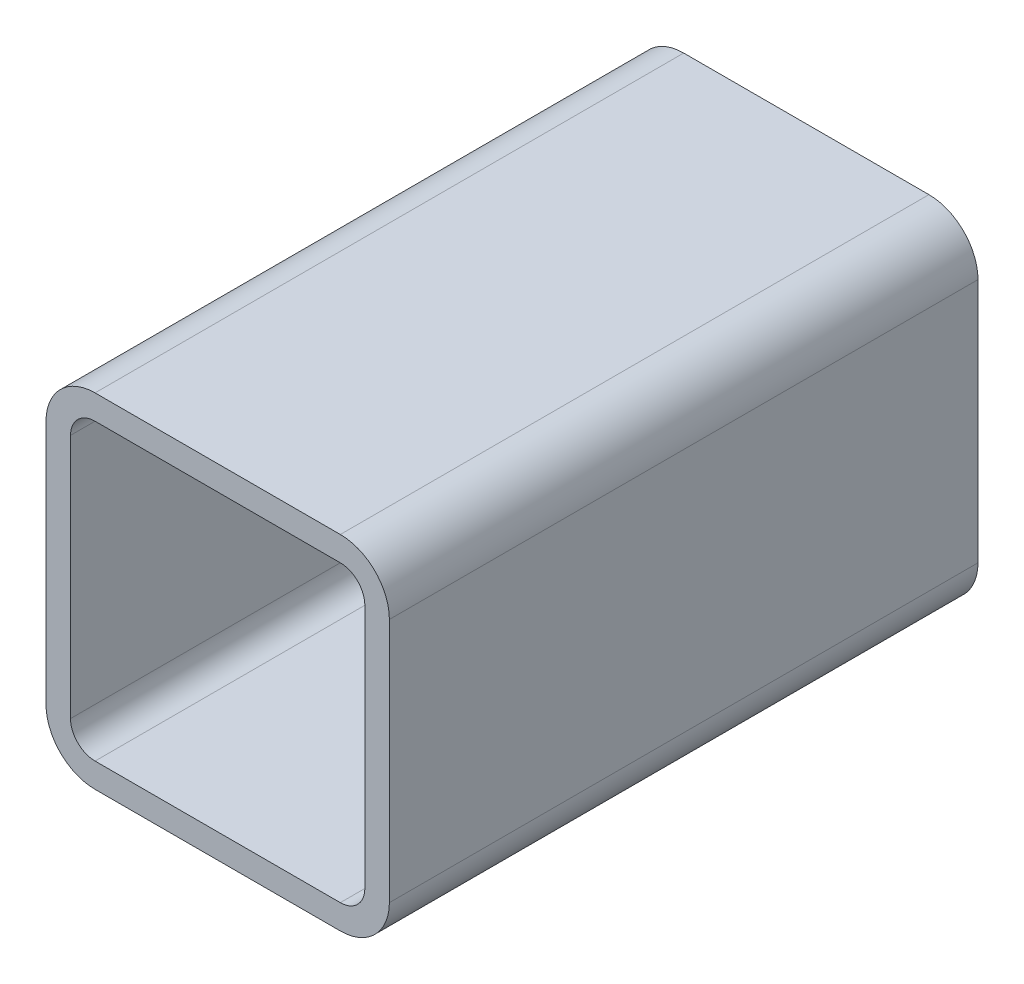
ISO-10303-21;
HEADER;
FILE_DESCRIPTION(('STEP AP214'),'2;1');
FILE_NAME('part.step','',(''),(''),'','','');
FILE_SCHEMA(('AUTOMOTIVE_DESIGN { 1 0 10303 214 1 1 1 1 }'));
ENDSEC;
DATA;
#1=APPLICATION_CONTEXT('core data for automotive mechanical design processes');
#2=APPLICATION_PROTOCOL_DEFINITION('international standard','automotive_design',2000,#1);
#3=PRODUCT_CONTEXT('',#1,'mechanical');
#4=PRODUCT('Part','Part','',(#3));
#5=PRODUCT_RELATED_PRODUCT_CATEGORY('part','',(#4));
#6=PRODUCT_DEFINITION_FORMATION('','',#4);
#7=PRODUCT_DEFINITION_CONTEXT('part definition',#1,'design');
#8=PRODUCT_DEFINITION('design','',#6,#7);
#9=PRODUCT_DEFINITION_SHAPE('','',#8);
#10=(LENGTH_UNIT() NAMED_UNIT(*) SI_UNIT(.MILLI.,.METRE.));
#11=(NAMED_UNIT(*) PLANE_ANGLE_UNIT() SI_UNIT($,.RADIAN.));
#12=(NAMED_UNIT(*) SI_UNIT($,.STERADIAN.) SOLID_ANGLE_UNIT());
#13=UNCERTAINTY_MEASURE_WITH_UNIT(LENGTH_MEASURE(1.E-05),#10,'distance_accuracy_value','');
#14=(GEOMETRIC_REPRESENTATION_CONTEXT(3) GLOBAL_UNCERTAINTY_ASSIGNED_CONTEXT((#13)) GLOBAL_UNIT_ASSIGNED_CONTEXT((#10,
#11,#12)) REPRESENTATION_CONTEXT('',''));
#15=CARTESIAN_POINT('',(0.,0.,0.));
#16=DIRECTION('',(0.,0.,1.));
#17=DIRECTION('',(1.,0.,0.));
#18=AXIS2_PLACEMENT_3D('',#15,#16,#17);
#19=CARTESIAN_POINT('',(27.6048786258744,154.389039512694,304.8));
#20=DIRECTION('',(0.,0.,1.));
#21=DIRECTION('',(1.,0.,0.));
#22=AXIS2_PLACEMENT_3D('',#19,#20,#21);
#23=PLANE('',#22);
#24=CARTESIAN_POINT('',(27.6048786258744,154.389039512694,304.8));
#25=DIRECTION('',(0.,0.,1.));
#26=DIRECTION('',(1.,0.,0.));
#27=AXIS2_PLACEMENT_3D('',#24,#25,#26);
#28=CIRCLE('',#27,25.4);
#29=CARTESIAN_POINT('',(27.6048786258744,179.789039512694,304.8));
#30=VERTEX_POINT('',#29);
#31=CARTESIAN_POINT('',(2.20487862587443,154.389039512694,304.8));
#32=VERTEX_POINT('',#31);
#33=EDGE_CURVE('E211',#30,#32,#28,.T.);
#34=ORIENTED_EDGE('',*,*,#33,.T.);
#35=DIRECTION('',(0.,-1.,0.));
#36=VECTOR('',#35,1.);
#37=CARTESIAN_POINT('',(2.20487862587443,27.3890395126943,304.8));
#38=LINE('',#37,#36);
#39=CARTESIAN_POINT('',(2.20487862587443,27.3890395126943,304.8));
#40=VERTEX_POINT('',#39);
#41=EDGE_CURVE('E214',#32,#40,#38,.T.);
#42=ORIENTED_EDGE('',*,*,#41,.T.);
#43=CARTESIAN_POINT('',(27.6048786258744,27.3890395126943,304.8));
#44=DIRECTION('',(0.,0.,1.));
#45=DIRECTION('',(1.,0.,0.));
#46=AXIS2_PLACEMENT_3D('',#43,#44,#45);
#47=CIRCLE('',#46,25.4);
#48=CARTESIAN_POINT('',(27.6048786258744,1.98903951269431,304.8));
#49=VERTEX_POINT('',#48);
#50=EDGE_CURVE('E217',#40,#49,#47,.T.);
#51=ORIENTED_EDGE('',*,*,#50,.T.);
#52=DIRECTION('',(1.,0.,0.));
#53=VECTOR('',#52,1.);
#54=CARTESIAN_POINT('',(154.604878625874,1.98903951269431,304.8));
#55=LINE('',#54,#53);
#56=CARTESIAN_POINT('',(154.604878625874,1.98903951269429,304.8));
#57=VERTEX_POINT('',#56);
#58=EDGE_CURVE('E219',#49,#57,#55,.T.);
#59=ORIENTED_EDGE('',*,*,#58,.T.);
#60=CARTESIAN_POINT('',(154.604878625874,27.3890395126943,304.8));
#61=DIRECTION('',(0.,0.,1.));
#62=DIRECTION('',(1.,0.,0.));
#63=AXIS2_PLACEMENT_3D('',#60,#61,#62);
#64=CIRCLE('',#63,25.4);
#65=CARTESIAN_POINT('',(180.004878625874,27.3890395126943,304.8));
#66=VERTEX_POINT('',#65);
#67=EDGE_CURVE('E221',#57,#66,#64,.T.);
#68=ORIENTED_EDGE('',*,*,#67,.T.);
#69=DIRECTION('',(0.,1.,0.));
#70=VECTOR('',#69,1.);
#71=CARTESIAN_POINT('',(180.004878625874,154.389039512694,304.8));
#72=LINE('',#71,#70);
#73=CARTESIAN_POINT('',(180.004878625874,154.389039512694,304.8));
#74=VERTEX_POINT('',#73);
#75=EDGE_CURVE('E223',#66,#74,#72,.T.);
#76=ORIENTED_EDGE('',*,*,#75,.T.);
#77=CARTESIAN_POINT('',(154.604878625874,154.389039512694,304.8));
#78=DIRECTION('',(0.,0.,1.));
#79=DIRECTION('',(1.,0.,0.));
#80=AXIS2_PLACEMENT_3D('',#77,#78,#79);
#81=CIRCLE('',#80,25.4);
#82=CARTESIAN_POINT('',(154.604878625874,179.789039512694,304.8));
#83=VERTEX_POINT('',#82);
#84=EDGE_CURVE('E225',#74,#83,#81,.T.);
#85=ORIENTED_EDGE('',*,*,#84,.T.);
#86=DIRECTION('',(-1.,0.,0.));
#87=VECTOR('',#86,1.);
#88=CARTESIAN_POINT('',(27.6048786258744,179.789039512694,304.8));
#89=LINE('',#88,#87);
#90=EDGE_CURVE('E227',#83,#30,#89,.T.);
#91=ORIENTED_EDGE('',*,*,#90,.T.);
#92=EDGE_LOOP('',(#34,#42,#51,#59,#68,#76,#85,#91));
#93=FACE_BOUND('',#92,.T.);
#94=DIRECTION('',(0.,-1.,0.));
#95=VECTOR('',#94,1.);
#96=CARTESIAN_POINT('',(14.9048786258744,27.3890395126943,304.8));
#97=LINE('',#96,#95);
#98=CARTESIAN_POINT('',(14.9048786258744,154.389039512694,304.8));
#99=VERTEX_POINT('',#98);
#100=CARTESIAN_POINT('',(14.9048786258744,27.3890395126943,304.8));
#101=VERTEX_POINT('',#100);
#102=EDGE_CURVE('E154',#99,#101,#97,.T.);
#103=ORIENTED_EDGE('',*,*,#102,.F.);
#104=CARTESIAN_POINT('',(27.6048786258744,154.389039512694,304.8));
#105=DIRECTION('',(0.,0.,1.));
#106=DIRECTION('',(1.,0.,0.));
#107=AXIS2_PLACEMENT_3D('',#104,#105,#106);
#108=CIRCLE('',#107,12.7);
#109=CARTESIAN_POINT('',(27.6048786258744,167.089039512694,304.8));
#110=VERTEX_POINT('',#109);
#111=EDGE_CURVE('E146',#110,#99,#108,.T.);
#112=ORIENTED_EDGE('',*,*,#111,.F.);
#113=DIRECTION('',(-1.,0.,0.));
#114=VECTOR('',#113,1.);
#115=CARTESIAN_POINT('',(27.6048786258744,167.089039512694,304.8));
#116=LINE('',#115,#114);
#117=CARTESIAN_POINT('',(154.604878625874,167.089039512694,304.8));
#118=VERTEX_POINT('',#117);
#119=EDGE_CURVE('E179',#118,#110,#116,.T.);
#120=ORIENTED_EDGE('',*,*,#119,.F.);
#121=CARTESIAN_POINT('',(154.604878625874,154.389039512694,304.8));
#122=DIRECTION('',(0.,0.,1.));
#123=DIRECTION('',(1.,0.,0.));
#124=AXIS2_PLACEMENT_3D('',#121,#122,#123);
#125=CIRCLE('',#124,12.7);
#126=CARTESIAN_POINT('',(167.304878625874,154.389039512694,304.8));
#127=VERTEX_POINT('',#126);
#128=EDGE_CURVE('E177',#127,#118,#125,.T.);
#129=ORIENTED_EDGE('',*,*,#128,.F.);
#130=DIRECTION('',(0.,1.,0.));
#131=VECTOR('',#130,1.);
#132=CARTESIAN_POINT('',(167.304878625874,154.389039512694,304.8));
#133=LINE('',#132,#131);
#134=CARTESIAN_POINT('',(167.304878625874,27.3890395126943,304.8));
#135=VERTEX_POINT('',#134);
#136=EDGE_CURVE('E175',#135,#127,#133,.T.);
#137=ORIENTED_EDGE('',*,*,#136,.F.);
#138=CARTESIAN_POINT('',(154.604878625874,27.3890395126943,304.8));
#139=DIRECTION('',(0.,0.,1.));
#140=DIRECTION('',(1.,0.,0.));
#141=AXIS2_PLACEMENT_3D('',#138,#139,#140);
#142=CIRCLE('',#141,12.7);
#143=CARTESIAN_POINT('',(154.604878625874,14.6890395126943,304.8));
#144=VERTEX_POINT('',#143);
#145=EDGE_CURVE('E173',#144,#135,#142,.T.);
#146=ORIENTED_EDGE('',*,*,#145,.F.);
#147=DIRECTION('',(1.,0.,0.));
#148=VECTOR('',#147,1.);
#149=CARTESIAN_POINT('',(154.604878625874,14.6890395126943,304.8));
#150=LINE('',#149,#148);
#151=CARTESIAN_POINT('',(27.6048786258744,14.6890395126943,304.8));
#152=VERTEX_POINT('',#151);
#153=EDGE_CURVE('E169',#152,#144,#150,.T.);
#154=ORIENTED_EDGE('',*,*,#153,.F.);
#155=CARTESIAN_POINT('',(27.6048786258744,27.3890395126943,304.8));
#156=DIRECTION('',(0.,0.,1.));
#157=DIRECTION('',(1.,0.,0.));
#158=AXIS2_PLACEMENT_3D('',#155,#156,#157);
#159=CIRCLE('',#158,12.7);
#160=EDGE_CURVE('E167',#101,#152,#159,.T.);
#161=ORIENTED_EDGE('',*,*,#160,.F.);
#162=EDGE_LOOP('',(#103,#112,#120,#129,#137,#146,#154,#161));
#163=FACE_BOUND('',#162,.T.);
#164=ADVANCED_FACE('F33',(#93,#163),#23,.T.);
#165=CARTESIAN_POINT('',(27.6048786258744,154.389039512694,0.));
#166=DIRECTION('',(0.,0.,1.));
#167=DIRECTION('',(1.,0.,0.));
#168=AXIS2_PLACEMENT_3D('',#165,#166,#167);
#169=PLANE('',#168);
#170=CARTESIAN_POINT('',(27.6048786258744,154.389039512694,0.));
#171=DIRECTION('',(0.,0.,1.));
#172=DIRECTION('',(1.,0.,0.));
#173=AXIS2_PLACEMENT_3D('',#170,#171,#172);
#174=CIRCLE('',#173,25.4);
#175=CARTESIAN_POINT('',(27.6048786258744,179.789039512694,0.));
#176=VERTEX_POINT('',#175);
#177=CARTESIAN_POINT('',(2.20487862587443,154.389039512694,0.));
#178=VERTEX_POINT('',#177);
#179=EDGE_CURVE('E162',#176,#178,#174,.T.);
#180=ORIENTED_EDGE('',*,*,#179,.F.);
#181=DIRECTION('',(-1.,0.,0.));
#182=VECTOR('',#181,1.);
#183=CARTESIAN_POINT('',(27.6048786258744,179.789039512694,0.));
#184=LINE('',#183,#182);
#185=CARTESIAN_POINT('',(154.604878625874,179.789039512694,0.));
#186=VERTEX_POINT('',#185);
#187=EDGE_CURVE('E215',#186,#176,#184,.T.);
#188=ORIENTED_EDGE('',*,*,#187,.F.);
#189=CARTESIAN_POINT('',(154.604878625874,154.389039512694,0.));
#190=DIRECTION('',(0.,0.,1.));
#191=DIRECTION('',(1.,0.,0.));
#192=AXIS2_PLACEMENT_3D('',#189,#190,#191);
#193=CIRCLE('',#192,25.4);
#194=CARTESIAN_POINT('',(180.004878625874,154.389039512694,0.));
#195=VERTEX_POINT('',#194);
#196=EDGE_CURVE('E242',#195,#186,#193,.T.);
#197=ORIENTED_EDGE('',*,*,#196,.F.);
#198=DIRECTION('',(0.,1.,0.));
#199=VECTOR('',#198,1.);
#200=CARTESIAN_POINT('',(180.004878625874,154.389039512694,0.));
#201=LINE('',#200,#199);
#202=CARTESIAN_POINT('',(180.004878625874,27.3890395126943,0.));
#203=VERTEX_POINT('',#202);
#204=EDGE_CURVE('E240',#203,#195,#201,.T.);
#205=ORIENTED_EDGE('',*,*,#204,.F.);
#206=CARTESIAN_POINT('',(154.604878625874,27.3890395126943,0.));
#207=DIRECTION('',(0.,0.,1.));
#208=DIRECTION('',(1.,0.,0.));
#209=AXIS2_PLACEMENT_3D('',#206,#207,#208);
#210=CIRCLE('',#209,25.4);
#211=CARTESIAN_POINT('',(154.604878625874,1.98903951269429,0.));
#212=VERTEX_POINT('',#211);
#213=EDGE_CURVE('E238',#212,#203,#210,.T.);
#214=ORIENTED_EDGE('',*,*,#213,.F.);
#215=DIRECTION('',(1.,0.,0.));
#216=VECTOR('',#215,1.);
#217=CARTESIAN_POINT('',(154.604878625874,1.98903951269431,0.));
#218=LINE('',#217,#216);
#219=CARTESIAN_POINT('',(27.6048786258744,1.98903951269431,0.));
#220=VERTEX_POINT('',#219);
#221=EDGE_CURVE('E236',#220,#212,#218,.T.);
#222=ORIENTED_EDGE('',*,*,#221,.F.);
#223=CARTESIAN_POINT('',(27.6048786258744,27.3890395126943,0.));
#224=DIRECTION('',(0.,0.,1.));
#225=DIRECTION('',(1.,0.,0.));
#226=AXIS2_PLACEMENT_3D('',#223,#224,#225);
#227=CIRCLE('',#226,25.4);
#228=CARTESIAN_POINT('',(2.20487862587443,27.3890395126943,0.));
#229=VERTEX_POINT('',#228);
#230=EDGE_CURVE('E234',#229,#220,#227,.T.);
#231=ORIENTED_EDGE('',*,*,#230,.F.);
#232=DIRECTION('',(0.,-1.,0.));
#233=VECTOR('',#232,1.);
#234=CARTESIAN_POINT('',(2.20487862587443,27.3890395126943,0.));
#235=LINE('',#234,#233);
#236=EDGE_CURVE('E232',#178,#229,#235,.T.);
#237=ORIENTED_EDGE('',*,*,#236,.F.);
#238=EDGE_LOOP('',(#180,#188,#197,#205,#214,#222,#231,#237));
#239=FACE_BOUND('',#238,.T.);
#240=CARTESIAN_POINT('',(27.6048786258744,154.389039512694,0.));
#241=DIRECTION('',(0.,0.,1.));
#242=DIRECTION('',(1.,0.,0.));
#243=AXIS2_PLACEMENT_3D('',#240,#241,#242);
#244=CIRCLE('',#243,12.7);
#245=CARTESIAN_POINT('',(27.6048786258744,167.089039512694,0.));
#246=VERTEX_POINT('',#245);
#247=CARTESIAN_POINT('',(14.9048786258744,154.389039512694,0.));
#248=VERTEX_POINT('',#247);
#249=EDGE_CURVE('E56',#246,#248,#244,.T.);
#250=ORIENTED_EDGE('',*,*,#249,.T.);
#251=DIRECTION('',(0.,-1.,0.));
#252=VECTOR('',#251,1.);
#253=CARTESIAN_POINT('',(14.9048786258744,27.3890395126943,0.));
#254=LINE('',#253,#252);
#255=CARTESIAN_POINT('',(14.9048786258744,27.3890395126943,0.));
#256=VERTEX_POINT('',#255);
#257=EDGE_CURVE('E161',#248,#256,#254,.T.);
#258=ORIENTED_EDGE('',*,*,#257,.T.);
#259=CARTESIAN_POINT('',(27.6048786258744,27.3890395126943,0.));
#260=DIRECTION('',(0.,0.,1.));
#261=DIRECTION('',(1.,0.,0.));
#262=AXIS2_PLACEMENT_3D('',#259,#260,#261);
#263=CIRCLE('',#262,12.7);
#264=CARTESIAN_POINT('',(27.6048786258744,14.6890395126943,0.));
#265=VERTEX_POINT('',#264);
#266=EDGE_CURVE('E183',#256,#265,#263,.T.);
#267=ORIENTED_EDGE('',*,*,#266,.T.);
#268=DIRECTION('',(1.,0.,0.));
#269=VECTOR('',#268,1.);
#270=CARTESIAN_POINT('',(154.604878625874,14.6890395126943,0.));
#271=LINE('',#270,#269);
#272=CARTESIAN_POINT('',(154.604878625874,14.6890395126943,0.));
#273=VERTEX_POINT('',#272);
#274=EDGE_CURVE('E186',#265,#273,#271,.T.);
#275=ORIENTED_EDGE('',*,*,#274,.T.);
#276=CARTESIAN_POINT('',(154.604878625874,27.3890395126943,0.));
#277=DIRECTION('',(0.,0.,1.));
#278=DIRECTION('',(1.,0.,0.));
#279=AXIS2_PLACEMENT_3D('',#276,#277,#278);
#280=CIRCLE('',#279,12.7);
#281=CARTESIAN_POINT('',(167.304878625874,27.3890395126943,0.));
#282=VERTEX_POINT('',#281);
#283=EDGE_CURVE('E189',#273,#282,#280,.T.);
#284=ORIENTED_EDGE('',*,*,#283,.T.);
#285=DIRECTION('',(0.,1.,0.));
#286=VECTOR('',#285,1.);
#287=CARTESIAN_POINT('',(167.304878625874,154.389039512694,0.));
#288=LINE('',#287,#286);
#289=CARTESIAN_POINT('',(167.304878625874,154.389039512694,0.));
#290=VERTEX_POINT('',#289);
#291=EDGE_CURVE('E192',#282,#290,#288,.T.);
#292=ORIENTED_EDGE('',*,*,#291,.T.);
#293=CARTESIAN_POINT('',(154.604878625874,154.389039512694,0.));
#294=DIRECTION('',(0.,0.,1.));
#295=DIRECTION('',(1.,0.,0.));
#296=AXIS2_PLACEMENT_3D('',#293,#294,#295);
#297=CIRCLE('',#296,12.7);
#298=CARTESIAN_POINT('',(154.604878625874,167.089039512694,0.));
#299=VERTEX_POINT('',#298);
#300=EDGE_CURVE('E195',#290,#299,#297,.T.);
#301=ORIENTED_EDGE('',*,*,#300,.T.);
#302=DIRECTION('',(-1.,0.,0.));
#303=VECTOR('',#302,1.);
#304=CARTESIAN_POINT('',(27.6048786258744,167.089039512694,0.));
#305=LINE('',#304,#303);
#306=EDGE_CURVE('E155',#299,#246,#305,.T.);
#307=ORIENTED_EDGE('',*,*,#306,.T.);
#308=EDGE_LOOP('',(#250,#258,#267,#275,#284,#292,#301,#307));
#309=FACE_BOUND('',#308,.T.);
#310=ADVANCED_FACE('F272',(#239,#309),#169,.F.);
#311=CARTESIAN_POINT('',(27.6048786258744,154.389039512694,304.8));
#312=DIRECTION('',(0.,0.,-1.));
#313=DIRECTION('',(-1.,0.,0.));
#314=AXIS2_PLACEMENT_3D('',#311,#312,#313);
#315=CYLINDRICAL_SURFACE('',#314,25.4);
#316=ORIENTED_EDGE('',*,*,#179,.T.);
#317=DIRECTION('',(0.,0.,-1.));
#318=VECTOR('',#317,1.);
#319=CARTESIAN_POINT('',(2.20487862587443,154.389039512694,304.8));
#320=LINE('',#319,#318);
#321=EDGE_CURVE('E11',#32,#178,#320,.T.);
#322=ORIENTED_EDGE('',*,*,#321,.F.);
#323=ORIENTED_EDGE('',*,*,#33,.F.);
#324=DIRECTION('',(0.,0.,-1.));
#325=VECTOR('',#324,1.);
#326=CARTESIAN_POINT('',(27.6048786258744,179.789039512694,304.8));
#327=LINE('',#326,#325);
#328=EDGE_CURVE('E229',#30,#176,#327,.T.);
#329=ORIENTED_EDGE('',*,*,#328,.T.);
#330=EDGE_LOOP('',(#316,#322,#323,#329));
#331=FACE_BOUND('',#330,.T.);
#332=ADVANCED_FACE('F35',(#331),#315,.T.);
#333=CARTESIAN_POINT('',(2.20487862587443,27.3890395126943,304.8));
#334=DIRECTION('',(1.,0.,0.));
#335=DIRECTION('',(0.,0.,-1.));
#336=AXIS2_PLACEMENT_3D('',#333,#334,#335);
#337=PLANE('',#336);
#338=ORIENTED_EDGE('',*,*,#236,.T.);
#339=DIRECTION('',(0.,0.,-1.));
#340=VECTOR('',#339,1.);
#341=CARTESIAN_POINT('',(2.20487862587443,27.3890395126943,304.8));
#342=LINE('',#341,#340);
#343=EDGE_CURVE('E41',#40,#229,#342,.T.);
#344=ORIENTED_EDGE('',*,*,#343,.F.);
#345=ORIENTED_EDGE('',*,*,#41,.F.);
#346=ORIENTED_EDGE('',*,*,#321,.T.);
#347=EDGE_LOOP('',(#338,#344,#345,#346));
#348=FACE_BOUND('',#347,.T.);
#349=ADVANCED_FACE('F289',(#348),#337,.F.);
#350=CARTESIAN_POINT('',(27.6048786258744,27.3890395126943,304.8));
#351=DIRECTION('',(0.,0.,-1.));
#352=DIRECTION('',(-1.,0.,0.));
#353=AXIS2_PLACEMENT_3D('',#350,#351,#352);
#354=CYLINDRICAL_SURFACE('',#353,25.4);
#355=ORIENTED_EDGE('',*,*,#230,.T.);
#356=DIRECTION('',(0.,0.,-1.));
#357=VECTOR('',#356,1.);
#358=CARTESIAN_POINT('',(27.6048786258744,1.98903951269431,304.8));
#359=LINE('',#358,#357);
#360=EDGE_CURVE('E259',#49,#220,#359,.T.);
#361=ORIENTED_EDGE('',*,*,#360,.F.);
#362=ORIENTED_EDGE('',*,*,#50,.F.);
#363=ORIENTED_EDGE('',*,*,#343,.T.);
#364=EDGE_LOOP('',(#355,#361,#362,#363));
#365=FACE_BOUND('',#364,.T.);
#366=ADVANCED_FACE('F266',(#365),#354,.T.);
#367=CARTESIAN_POINT('',(154.604878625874,1.98903951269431,304.8));
#368=DIRECTION('',(0.,1.,0.));
#369=DIRECTION('',(0.,0.,1.));
#370=AXIS2_PLACEMENT_3D('',#367,#368,#369);
#371=PLANE('',#370);
#372=ORIENTED_EDGE('',*,*,#221,.T.);
#373=DIRECTION('',(0.,0.,-1.));
#374=VECTOR('',#373,1.);
#375=CARTESIAN_POINT('',(154.604878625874,1.98903951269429,304.8));
#376=LINE('',#375,#374);
#377=EDGE_CURVE('E256',#57,#212,#376,.T.);
#378=ORIENTED_EDGE('',*,*,#377,.F.);
#379=ORIENTED_EDGE('',*,*,#58,.F.);
#380=ORIENTED_EDGE('',*,*,#360,.T.);
#381=EDGE_LOOP('',(#372,#378,#379,#380));
#382=FACE_BOUND('',#381,.T.);
#383=ADVANCED_FACE('F278',(#382),#371,.F.);
#384=CARTESIAN_POINT('',(154.604878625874,27.3890395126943,304.8));
#385=DIRECTION('',(0.,0.,-1.));
#386=DIRECTION('',(-1.,0.,0.));
#387=AXIS2_PLACEMENT_3D('',#384,#385,#386);
#388=CYLINDRICAL_SURFACE('',#387,25.4);
#389=ORIENTED_EDGE('',*,*,#213,.T.);
#390=DIRECTION('',(0.,0.,-1.));
#391=VECTOR('',#390,1.);
#392=CARTESIAN_POINT('',(180.004878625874,27.3890395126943,304.8));
#393=LINE('',#392,#391);
#394=EDGE_CURVE('E253',#66,#203,#393,.T.);
#395=ORIENTED_EDGE('',*,*,#394,.F.);
#396=ORIENTED_EDGE('',*,*,#67,.F.);
#397=ORIENTED_EDGE('',*,*,#377,.T.);
#398=EDGE_LOOP('',(#389,#395,#396,#397));
#399=FACE_BOUND('',#398,.T.);
#400=ADVANCED_FACE('F282',(#399),#388,.T.);
#401=CARTESIAN_POINT('',(180.004878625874,154.389039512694,304.8));
#402=DIRECTION('',(-1.,0.,0.));
#403=DIRECTION('',(0.,0.,1.));
#404=AXIS2_PLACEMENT_3D('',#401,#402,#403);
#405=PLANE('',#404);
#406=ORIENTED_EDGE('',*,*,#204,.T.);
#407=DIRECTION('',(0.,0.,-1.));
#408=VECTOR('',#407,1.);
#409=CARTESIAN_POINT('',(180.004878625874,154.389039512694,304.8));
#410=LINE('',#409,#408);
#411=EDGE_CURVE('E250',#74,#195,#410,.T.);
#412=ORIENTED_EDGE('',*,*,#411,.F.);
#413=ORIENTED_EDGE('',*,*,#75,.F.);
#414=ORIENTED_EDGE('',*,*,#394,.T.);
#415=EDGE_LOOP('',(#406,#412,#413,#414));
#416=FACE_BOUND('',#415,.T.);
#417=ADVANCED_FACE('F302',(#416),#405,.F.);
#418=CARTESIAN_POINT('',(154.604878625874,154.389039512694,304.8));
#419=DIRECTION('',(0.,0.,-1.));
#420=DIRECTION('',(-1.,0.,0.));
#421=AXIS2_PLACEMENT_3D('',#418,#419,#420);
#422=CYLINDRICAL_SURFACE('',#421,25.4);
#423=ORIENTED_EDGE('',*,*,#196,.T.);
#424=DIRECTION('',(0.,0.,-1.));
#425=VECTOR('',#424,1.);
#426=CARTESIAN_POINT('',(154.604878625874,179.789039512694,304.8));
#427=LINE('',#426,#425);
#428=EDGE_CURVE('E247',#83,#186,#427,.T.);
#429=ORIENTED_EDGE('',*,*,#428,.F.);
#430=ORIENTED_EDGE('',*,*,#84,.F.);
#431=ORIENTED_EDGE('',*,*,#411,.T.);
#432=EDGE_LOOP('',(#423,#429,#430,#431));
#433=FACE_BOUND('',#432,.T.);
#434=ADVANCED_FACE('F300',(#433),#422,.T.);
#435=CARTESIAN_POINT('',(27.6048786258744,179.789039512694,304.8));
#436=DIRECTION('',(0.,-1.,0.));
#437=DIRECTION('',(0.,0.,-1.));
#438=AXIS2_PLACEMENT_3D('',#435,#436,#437);
#439=PLANE('',#438);
#440=ORIENTED_EDGE('',*,*,#187,.T.);
#441=ORIENTED_EDGE('',*,*,#328,.F.);
#442=ORIENTED_EDGE('',*,*,#90,.F.);
#443=ORIENTED_EDGE('',*,*,#428,.T.);
#444=EDGE_LOOP('',(#440,#441,#442,#443));
#445=FACE_BOUND('',#444,.T.);
#446=ADVANCED_FACE('F295',(#445),#439,.F.);
#447=CARTESIAN_POINT('',(27.6048786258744,154.389039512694,304.8));
#448=DIRECTION('',(0.,0.,-1.));
#449=DIRECTION('',(-1.,0.,0.));
#450=AXIS2_PLACEMENT_3D('',#447,#448,#449);
#451=CYLINDRICAL_SURFACE('',#450,12.7);
#452=ORIENTED_EDGE('',*,*,#249,.F.);
#453=DIRECTION('',(0.,0.,-1.));
#454=VECTOR('',#453,1.);
#455=CARTESIAN_POINT('',(27.6048786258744,167.089039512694,304.8));
#456=LINE('',#455,#454);
#457=EDGE_CURVE('E150',#110,#246,#456,.T.);
#458=ORIENTED_EDGE('',*,*,#457,.F.);
#459=ORIENTED_EDGE('',*,*,#111,.T.);
#460=DIRECTION('',(0.,0.,-1.));
#461=VECTOR('',#460,1.);
#462=CARTESIAN_POINT('',(14.9048786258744,154.389039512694,304.8));
#463=LINE('',#462,#461);
#464=EDGE_CURVE('E149',#99,#248,#463,.T.);
#465=ORIENTED_EDGE('',*,*,#464,.T.);
#466=EDGE_LOOP('',(#452,#458,#459,#465));
#467=FACE_BOUND('',#466,.T.);
#468=ADVANCED_FACE('F148',(#467),#451,.F.);
#469=CARTESIAN_POINT('',(14.9048786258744,27.3890395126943,304.8));
#470=DIRECTION('',(1.,0.,0.));
#471=DIRECTION('',(0.,0.,-1.));
#472=AXIS2_PLACEMENT_3D('',#469,#470,#471);
#473=PLANE('',#472);
#474=ORIENTED_EDGE('',*,*,#257,.F.);
#475=ORIENTED_EDGE('',*,*,#464,.F.);
#476=ORIENTED_EDGE('',*,*,#102,.T.);
#477=DIRECTION('',(0.,0.,-1.));
#478=VECTOR('',#477,1.);
#479=CARTESIAN_POINT('',(14.9048786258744,27.3890395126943,304.8));
#480=LINE('',#479,#478);
#481=EDGE_CURVE('E163',#101,#256,#480,.T.);
#482=ORIENTED_EDGE('',*,*,#481,.T.);
#483=EDGE_LOOP('',(#474,#475,#476,#482));
#484=FACE_BOUND('',#483,.T.);
#485=ADVANCED_FACE('F158',(#484),#473,.T.);
#486=CARTESIAN_POINT('',(27.6048786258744,27.3890395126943,304.8));
#487=DIRECTION('',(0.,0.,-1.));
#488=DIRECTION('',(-1.,0.,0.));
#489=AXIS2_PLACEMENT_3D('',#486,#487,#488);
#490=CYLINDRICAL_SURFACE('',#489,12.7);
#491=ORIENTED_EDGE('',*,*,#266,.F.);
#492=ORIENTED_EDGE('',*,*,#481,.F.);
#493=ORIENTED_EDGE('',*,*,#160,.T.);
#494=DIRECTION('',(0.,0.,-1.));
#495=VECTOR('',#494,1.);
#496=CARTESIAN_POINT('',(27.6048786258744,14.6890395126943,304.8));
#497=LINE('',#496,#495);
#498=EDGE_CURVE('E208',#152,#265,#497,.T.);
#499=ORIENTED_EDGE('',*,*,#498,.T.);
#500=EDGE_LOOP('',(#491,#492,#493,#499));
#501=FACE_BOUND('',#500,.T.);
#502=ADVANCED_FACE('F327',(#501),#490,.F.);
#503=CARTESIAN_POINT('',(154.604878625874,14.6890395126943,304.8));
#504=DIRECTION('',(0.,1.,0.));
#505=DIRECTION('',(0.,0.,1.));
#506=AXIS2_PLACEMENT_3D('',#503,#504,#505);
#507=PLANE('',#506);
#508=ORIENTED_EDGE('',*,*,#274,.F.);
#509=ORIENTED_EDGE('',*,*,#498,.F.);
#510=ORIENTED_EDGE('',*,*,#153,.T.);
#511=DIRECTION('',(0.,0.,-1.));
#512=VECTOR('',#511,1.);
#513=CARTESIAN_POINT('',(154.604878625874,14.6890395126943,304.8));
#514=LINE('',#513,#512);
#515=EDGE_CURVE('E206',#144,#273,#514,.T.);
#516=ORIENTED_EDGE('',*,*,#515,.T.);
#517=EDGE_LOOP('',(#508,#509,#510,#516));
#518=FACE_BOUND('',#517,.T.);
#519=ADVANCED_FACE('F331',(#518),#507,.T.);
#520=CARTESIAN_POINT('',(154.604878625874,27.3890395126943,304.8));
#521=DIRECTION('',(0.,0.,-1.));
#522=DIRECTION('',(-1.,0.,0.));
#523=AXIS2_PLACEMENT_3D('',#520,#521,#522);
#524=CYLINDRICAL_SURFACE('',#523,12.7);
#525=ORIENTED_EDGE('',*,*,#283,.F.);
#526=ORIENTED_EDGE('',*,*,#515,.F.);
#527=ORIENTED_EDGE('',*,*,#145,.T.);
#528=DIRECTION('',(0.,0.,-1.));
#529=VECTOR('',#528,1.);
#530=CARTESIAN_POINT('',(167.304878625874,27.3890395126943,304.8));
#531=LINE('',#530,#529);
#532=EDGE_CURVE('E204',#135,#282,#531,.T.);
#533=ORIENTED_EDGE('',*,*,#532,.T.);
#534=EDGE_LOOP('',(#525,#526,#527,#533));
#535=FACE_BOUND('',#534,.T.);
#536=ADVANCED_FACE('F337',(#535),#524,.F.);
#537=CARTESIAN_POINT('',(167.304878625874,154.389039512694,304.8));
#538=DIRECTION('',(-1.,0.,0.));
#539=DIRECTION('',(0.,0.,1.));
#540=AXIS2_PLACEMENT_3D('',#537,#538,#539);
#541=PLANE('',#540);
#542=ORIENTED_EDGE('',*,*,#291,.F.);
#543=ORIENTED_EDGE('',*,*,#532,.F.);
#544=ORIENTED_EDGE('',*,*,#136,.T.);
#545=DIRECTION('',(0.,0.,-1.));
#546=VECTOR('',#545,1.);
#547=CARTESIAN_POINT('',(167.304878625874,154.389039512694,304.8));
#548=LINE('',#547,#546);
#549=EDGE_CURVE('E202',#127,#290,#548,.T.);
#550=ORIENTED_EDGE('',*,*,#549,.T.);
#551=EDGE_LOOP('',(#542,#543,#544,#550));
#552=FACE_BOUND('',#551,.T.);
#553=ADVANCED_FACE('F341',(#552),#541,.T.);
#554=CARTESIAN_POINT('',(154.604878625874,154.389039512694,304.8));
#555=DIRECTION('',(0.,0.,-1.));
#556=DIRECTION('',(-1.,0.,0.));
#557=AXIS2_PLACEMENT_3D('',#554,#555,#556);
#558=CYLINDRICAL_SURFACE('',#557,12.7);
#559=ORIENTED_EDGE('',*,*,#300,.F.);
#560=ORIENTED_EDGE('',*,*,#549,.F.);
#561=ORIENTED_EDGE('',*,*,#128,.T.);
#562=DIRECTION('',(0.,0.,-1.));
#563=VECTOR('',#562,1.);
#564=CARTESIAN_POINT('',(154.604878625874,167.089039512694,304.8));
#565=LINE('',#564,#563);
#566=EDGE_CURVE('E48',#118,#299,#565,.T.);
#567=ORIENTED_EDGE('',*,*,#566,.T.);
#568=EDGE_LOOP('',(#559,#560,#561,#567));
#569=FACE_BOUND('',#568,.T.);
#570=ADVANCED_FACE('F345',(#569),#558,.F.);
#571=CARTESIAN_POINT('',(27.6048786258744,167.089039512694,304.8));
#572=DIRECTION('',(0.,-1.,0.));
#573=DIRECTION('',(0.,0.,-1.));
#574=AXIS2_PLACEMENT_3D('',#571,#572,#573);
#575=PLANE('',#574);
#576=ORIENTED_EDGE('',*,*,#306,.F.);
#577=ORIENTED_EDGE('',*,*,#566,.F.);
#578=ORIENTED_EDGE('',*,*,#119,.T.);
#579=ORIENTED_EDGE('',*,*,#457,.T.);
#580=EDGE_LOOP('',(#576,#577,#578,#579));
#581=FACE_BOUND('',#580,.T.);
#582=ADVANCED_FACE('F349',(#581),#575,.T.);
#583=CLOSED_SHELL('',(#164,#310,#332,#349,#366,#383,#400,#417,#434,#446,#468,#485,#502,#519,
#536,#553,#570,#582));
#584=MANIFOLD_SOLID_BREP('B2',#583);
#585=ADVANCED_BREP_SHAPE_REPRESENTATION('',(#18,#584),#14);
#586=SHAPE_DEFINITION_REPRESENTATION(#9,#585);
ENDSEC;
END-ISO-10303-21;
